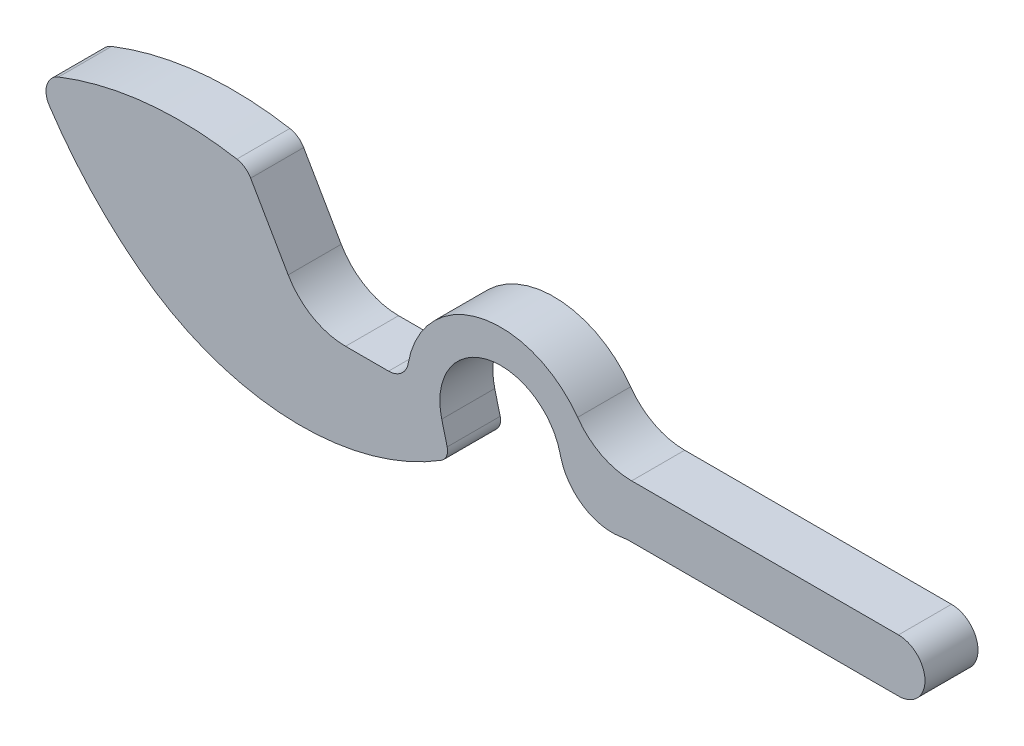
from build123d import *

# Parameters (mm, degrees)
ESQUISSE3_R             = 14.2
ESQUISSE3_R_2           = 9.2
BOSS_EXTRU_2_DEPTH      = 8
BOSS_EXTRU_3_START      = -8
ESQUISSE4_R             = 9.2
BOSS_EXTRU_3_DEPTH      = 8
ENL_V_MAT_EXTRU_2_DEPTH = 130.511283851
CONG_2_R                = 8
ENL_V_MAT_EXTRU_3_DEPTH = 130.511283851
CONG_5_R                = 2


with BuildPart() as part:
    # Esquisse3 → Boss.-Extru.2 (new body)
    with BuildSketch(Plane.XY.offset(1)):
        with Locations((47.5, -47.5)):
            Circle(ESQUISSE3_R)
        with Locations((47.5, -47.5)):
            Circle(ESQUISSE3_R_2, mode=Mode.SUBTRACT)
    extrude(amount=BOSS_EXTRU_2_DEPTH)

    # Esquisse4 → Boss.-Extru.3 (add)
    with BuildSketch(Plane.XY.offset(9).offset(BOSS_EXTRU_3_START)):
        with BuildLine():
            Line((67.239300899, -43.5), (107.5, -43.5))
            ThreePointArc((107.5, -43.5), (111.5, -47.5), (107.5, -51.5))
            Line((107.5, -51.5), (67.239300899, -51.5))
            ThreePointArc((67.239300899, -51.5), (62.648616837, -52.615990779), (59.082564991, -55.714876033))
            ThreePointArc((59.082564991, -55.714876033), (56.420625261, -58.548187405), (53.090055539, -60.553401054))
            ThreePointArc((53.090055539, -60.553401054), (12.205780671, -62.860722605), (-20.636928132, -38.402510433))
            ThreePointArc((-20.636928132, -38.402510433), (-20.991469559, -35.846196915), (-19.229550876, -33.960439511))
            ThreePointArc((-19.229550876, -33.960439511), (-5.968344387, -30.74584953), (7.668105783, -31.23616889))
            ThreePointArc((7.668105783, -31.23616889), (8.870845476, -31.732551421), (9.750296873, -32.691479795))
            Line((9.750296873, -32.691479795), (15.413248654, -42.5))
            ThreePointArc((15.413248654, -42.5), (19.073502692, -46.160254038), (24.073502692, -47.5))
            Line((24.073502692, -47.5), (30.563648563, -47.5))
            ThreePointArc((30.563648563, -47.5), (32.491112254, -46.798887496), (33.517663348, -45.023255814))
            ThreePointArc((33.517663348, -45.023255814), (44.390134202, -33.644721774), (59.082564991, -39.285123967))
            ThreePointArc((59.082564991, -39.285123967), (62.648616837, -42.384009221), (67.239300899, -43.5))
        make_face()
        with Locations((47.5, -47.5)):
            Circle(ESQUISSE4_R, mode=Mode.SUBTRACT)
    extrude(amount=BOSS_EXTRU_3_DEPTH)

    # Esquisse5 → Enl_v. mat.-Extru.2 (cut, through all)
    with BuildSketch(Plane.XY.offset(9)):
        with BuildLine():
            Line((38.583926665, -49.767958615), (42.211645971, -64.029687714))
            ThreePointArc((42.211645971, -64.029687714), (47.733748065, -62.550956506), (53.090055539, -60.553401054))
            ThreePointArc((53.090055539, -60.553401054), (56.420625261, -58.548187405), (59.082564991, -55.714876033))
            Line((59.082564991, -55.714876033), (56.416073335, -45.232041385))
            ThreePointArc((56.416073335, -45.232041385), (45.232041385, -38.583926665), (38.583926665, -49.767958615))
        make_face()
    extrude(amount=-ENL_V_MAT_EXTRU_2_DEPTH, mode=Mode.SUBTRACT)

    # Cong_2
    cong_2_edges = [part.edges().sort_by_distance(p)[0] for p in [
        (59.082564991, -55.714876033, 5),
        (42.211645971, -64.029687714, 5),
    ]]
    fillet(cong_2_edges, radius=CONG_2_R)

    # Esquisse7 → Enl_v. mat.-Extru.3 (cut, through all)
    with BuildSketch(Plane.XY.offset(9)):
        with BuildLine():
            Line((39.755259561, -54.372844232), (40.004230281, -55.35162805))
            ThreePointArc((40.004230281, -55.35162805), (38.695953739, -62.063402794), (32.678972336, -65.312316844))
            ThreePointArc((32.678972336, -65.312316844), (11.721441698, -62.712974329), (-7.037351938, -53.01336953))
            ThreePointArc((-7.037351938, -53.01336953), (16.13931356, -61.25304232), (39.755259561, -54.372844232))
        make_face()
    extrude(amount=-ENL_V_MAT_EXTRU_3_DEPTH, mode=Mode.SUBTRACT)

    # Cong_5
    cong_5_edges = [part.edges().sort_by_distance(p)[0] for p in [
        (39.755259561, -54.372844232, 5),
    ]]
    fillet(cong_5_edges, radius=CONG_5_R)


solid = part.part
